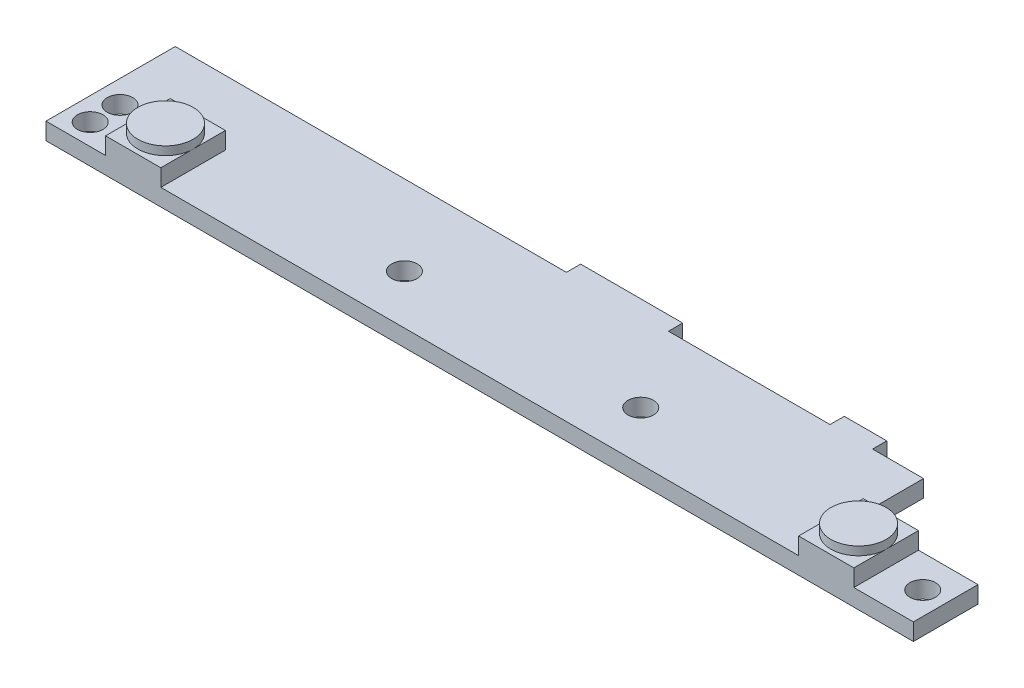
ISO-10303-21;
HEADER;
FILE_DESCRIPTION(('STEP AP214'),'2;1');
FILE_NAME('part.step','',(''),(''),'','','');
FILE_SCHEMA(('AUTOMOTIVE_DESIGN { 1 0 10303 214 1 1 1 1 }'));
ENDSEC;
DATA;
#1=APPLICATION_CONTEXT('core data for automotive mechanical design processes');
#2=APPLICATION_PROTOCOL_DEFINITION('international standard','automotive_design',2000,#1);
#3=PRODUCT_CONTEXT('',#1,'mechanical');
#4=PRODUCT('Part','Part','',(#3));
#5=PRODUCT_RELATED_PRODUCT_CATEGORY('part','',(#4));
#6=PRODUCT_DEFINITION_FORMATION('','',#4);
#7=PRODUCT_DEFINITION_CONTEXT('part definition',#1,'design');
#8=PRODUCT_DEFINITION('design','',#6,#7);
#9=PRODUCT_DEFINITION_SHAPE('','',#8);
#10=(LENGTH_UNIT() NAMED_UNIT(*) SI_UNIT(.MILLI.,.METRE.));
#11=(NAMED_UNIT(*) PLANE_ANGLE_UNIT() SI_UNIT($,.RADIAN.));
#12=(NAMED_UNIT(*) SI_UNIT($,.STERADIAN.) SOLID_ANGLE_UNIT());
#13=UNCERTAINTY_MEASURE_WITH_UNIT(LENGTH_MEASURE(1.E-05),#10,'distance_accuracy_value','');
#14=(GEOMETRIC_REPRESENTATION_CONTEXT(3) GLOBAL_UNCERTAINTY_ASSIGNED_CONTEXT((#13)) GLOBAL_UNIT_ASSIGNED_CONTEXT((#10,
#11,#12)) REPRESENTATION_CONTEXT('',''));
#15=CARTESIAN_POINT('',(0.,0.,0.));
#16=DIRECTION('',(0.,0.,1.));
#17=DIRECTION('',(1.,0.,0.));
#18=AXIS2_PLACEMENT_3D('',#15,#16,#17);
#19=CARTESIAN_POINT('',(0.,4.,0.));
#20=DIRECTION('',(0.,-1.,0.));
#21=DIRECTION('',(0.,0.,-1.));
#22=AXIS2_PLACEMENT_3D('',#19,#20,#21);
#23=PLANE('',#22);
#24=DIRECTION('',(0.,0.,-1.));
#25=VECTOR('',#24,1.);
#26=CARTESIAN_POINT('',(44.,4.,0.));
#27=LINE('',#26,#25);
#28=CARTESIAN_POINT('',(44.,4.,7.60000000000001));
#29=VERTEX_POINT('',#28);
#30=CARTESIAN_POINT('',(44.,4.,3.80000000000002));
#31=VERTEX_POINT('',#30);
#32=EDGE_CURVE('E207',#29,#31,#27,.T.);
#33=ORIENTED_EDGE('',*,*,#32,.T.);
#34=CARTESIAN_POINT('',(40.75,4.,3.80000000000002));
#35=DIRECTION('',(0.,1.,0.));
#36=DIRECTION('',(0.,0.,1.));
#37=AXIS2_PLACEMENT_3D('',#34,#35,#36);
#38=CIRCLE('',#37,3.25);
#39=CARTESIAN_POINT('',(37.5,4.,3.80000000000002));
#40=VERTEX_POINT('',#39);
#41=EDGE_CURVE('E51',#40,#31,#38,.T.);
#42=ORIENTED_EDGE('',*,*,#41,.F.);
#43=DIRECTION('',(0.,0.,1.));
#44=VECTOR('',#43,1.);
#45=CARTESIAN_POINT('',(37.5,4.,0.));
#46=LINE('',#45,#44);
#47=CARTESIAN_POINT('',(37.5,4.,7.6));
#48=VERTEX_POINT('',#47);
#49=EDGE_CURVE('E205',#40,#48,#46,.T.);
#50=ORIENTED_EDGE('',*,*,#49,.T.);
#51=DIRECTION('',(-1.,0.,0.));
#52=VECTOR('',#51,1.);
#53=CARTESIAN_POINT('',(51.,4.,7.6));
#54=LINE('',#53,#52);
#55=EDGE_CURVE('E235',#29,#48,#54,.T.);
#56=ORIENTED_EDGE('',*,*,#55,.F.);
#57=EDGE_LOOP('',(#33,#42,#50,#56));
#58=FACE_BOUND('',#57,.T.);
#59=ADVANCED_FACE('F35',(#58),#23,.F.);
#60=CARTESIAN_POINT('',(0.,4.,0.));
#61=DIRECTION('',(0.,-1.,0.));
#62=DIRECTION('',(0.,0.,-1.));
#63=AXIS2_PLACEMENT_3D('',#60,#61,#62);
#64=PLANE('',#63);
#65=DIRECTION('',(0.,0.,-1.));
#66=VECTOR('',#65,1.);
#67=CARTESIAN_POINT('',(-37.5,4.,0.));
#68=LINE('',#67,#66);
#69=CARTESIAN_POINT('',(-37.5,4.,7.60000000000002));
#70=VERTEX_POINT('',#69);
#71=CARTESIAN_POINT('',(-37.5,4.,3.80000000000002));
#72=VERTEX_POINT('',#71);
#73=EDGE_CURVE('E465',#70,#72,#68,.T.);
#74=ORIENTED_EDGE('',*,*,#73,.T.);
#75=CARTESIAN_POINT('',(-40.75,4.,3.80000000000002));
#76=DIRECTION('',(0.,-1.,0.));
#77=DIRECTION('',(0.,0.,-1.));
#78=AXIS2_PLACEMENT_3D('',#75,#76,#77);
#79=CIRCLE('',#78,3.25);
#80=CARTESIAN_POINT('',(-44.,4.00000000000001,3.80000000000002));
#81=VERTEX_POINT('',#80);
#82=EDGE_CURVE('E11',#72,#81,#79,.T.);
#83=ORIENTED_EDGE('',*,*,#82,.T.);
#84=DIRECTION('',(0.,0.,1.));
#85=VECTOR('',#84,1.);
#86=CARTESIAN_POINT('',(-44.,4.,7.60000000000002));
#87=LINE('',#86,#85);
#88=CARTESIAN_POINT('',(-44.,4.,7.60000000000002));
#89=VERTEX_POINT('',#88);
#90=EDGE_CURVE('E471',#81,#89,#87,.T.);
#91=ORIENTED_EDGE('',*,*,#90,.T.);
#92=DIRECTION('',(1.,0.,0.));
#93=VECTOR('',#92,1.);
#94=CARTESIAN_POINT('',(-37.5,4.,7.60000000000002));
#95=LINE('',#94,#93);
#96=EDGE_CURVE('E475',#89,#70,#95,.T.);
#97=ORIENTED_EDGE('',*,*,#96,.T.);
#98=EDGE_LOOP('',(#74,#83,#91,#97));
#99=FACE_BOUND('',#98,.T.);
#100=ADVANCED_FACE('F509',(#99),#64,.F.);
#101=CARTESIAN_POINT('',(-51.,2.,0.));
#102=DIRECTION('',(0.,-1.,0.));
#103=DIRECTION('',(0.,0.,-1.));
#104=AXIS2_PLACEMENT_3D('',#101,#102,#103);
#105=PLANE('',#104);
#106=CARTESIAN_POINT('',(-48.3,2.,5.10000000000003));
#107=DIRECTION('',(0.,-1.,0.));
#108=DIRECTION('',(0.,0.,-1.));
#109=AXIS2_PLACEMENT_3D('',#106,#107,#108);
#110=CIRCLE('',#109,1.49999999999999);
#111=CARTESIAN_POINT('',(-48.3,2.,3.60000000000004));
#112=VERTEX_POINT('',#111);
#113=EDGE_CURVE('E39',#112,#112,#110,.T.);
#114=ORIENTED_EDGE('',*,*,#113,.T.);
#115=EDGE_LOOP('',(#114));
#116=FACE_BOUND('',#115,.T.);
#117=CARTESIAN_POINT('',(13.1494661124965,2.,1.81030675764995));
#118=DIRECTION('',(0.,-1.,0.));
#119=DIRECTION('',(0.,0.,-1.));
#120=AXIS2_PLACEMENT_3D('',#117,#118,#119);
#121=CIRCLE('',#120,1.49999999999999);
#122=CARTESIAN_POINT('',(13.1494661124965,2.,0.310306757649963));
#123=VERTEX_POINT('',#122);
#124=EDGE_CURVE('E431',#123,#123,#121,.T.);
#125=ORIENTED_EDGE('',*,*,#124,.T.);
#126=EDGE_LOOP('',(#125));
#127=FACE_BOUND('',#126,.T.);
#128=CARTESIAN_POINT('',(-48.3,2.,1.60000000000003));
#129=DIRECTION('',(0.,-1.,0.));
#130=DIRECTION('',(0.,0.,-1.));
#131=AXIS2_PLACEMENT_3D('',#128,#129,#130);
#132=CIRCLE('',#131,1.49999999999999);
#133=CARTESIAN_POINT('',(-48.3,2.,0.100000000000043));
#134=VERTEX_POINT('',#133);
#135=EDGE_CURVE('E453',#134,#134,#132,.T.);
#136=ORIENTED_EDGE('',*,*,#135,.T.);
#137=EDGE_LOOP('',(#136));
#138=FACE_BOUND('',#137,.T.);
#139=CARTESIAN_POINT('',(-14.6390767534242,2.,1.81030675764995));
#140=DIRECTION('',(0.,-1.,0.));
#141=DIRECTION('',(0.,0.,-1.));
#142=AXIS2_PLACEMENT_3D('',#139,#140,#141);
#143=CIRCLE('',#142,1.49999999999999);
#144=CARTESIAN_POINT('',(-14.6390767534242,2.,0.310306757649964));
#145=VERTEX_POINT('',#144);
#146=EDGE_CURVE('E428',#145,#145,#143,.T.);
#147=ORIENTED_EDGE('',*,*,#146,.T.);
#148=EDGE_LOOP('',(#147));
#149=FACE_BOUND('',#148,.T.);
#150=DIRECTION('',(0.,0.,-1.));
#151=VECTOR('',#150,1.);
#152=CARTESIAN_POINT('',(-37.5,2.,0.));
#153=LINE('',#152,#151);
#154=CARTESIAN_POINT('',(-37.5,2.,7.60000000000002));
#155=VERTEX_POINT('',#154);
#156=CARTESIAN_POINT('',(-37.5,2.,0.));
#157=VERTEX_POINT('',#156);
#158=EDGE_CURVE('E464',#155,#157,#153,.T.);
#159=ORIENTED_EDGE('',*,*,#158,.F.);
#160=DIRECTION('',(1.,0.,0.));
#161=VECTOR('',#160,1.);
#162=CARTESIAN_POINT('',(-51.,2.,7.60000000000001));
#163=LINE('',#162,#161);
#164=CARTESIAN_POINT('',(37.5,2.,7.60000000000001));
#165=VERTEX_POINT('',#164);
#166=EDGE_CURVE('E262',#155,#165,#163,.T.);
#167=ORIENTED_EDGE('',*,*,#166,.T.);
#168=DIRECTION('',(0.,0.,1.));
#169=VECTOR('',#168,1.);
#170=CARTESIAN_POINT('',(37.5,2.,0.));
#171=LINE('',#170,#169);
#172=CARTESIAN_POINT('',(37.5,2.,0.));
#173=VERTEX_POINT('',#172);
#174=EDGE_CURVE('E218',#173,#165,#171,.T.);
#175=ORIENTED_EDGE('',*,*,#174,.F.);
#176=DIRECTION('',(1.,0.,0.));
#177=VECTOR('',#176,1.);
#178=CARTESIAN_POINT('',(-51.,2.,0.));
#179=LINE('',#178,#177);
#180=CARTESIAN_POINT('',(37.,2.,0.));
#181=VERTEX_POINT('',#180);
#182=EDGE_CURVE('E251',#181,#173,#179,.T.);
#183=ORIENTED_EDGE('',*,*,#182,.F.);
#184=DIRECTION('',(0.,0.,1.));
#185=VECTOR('',#184,1.);
#186=CARTESIAN_POINT('',(37.,2.,-9.27313022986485));
#187=LINE('',#186,#185);
#188=CARTESIAN_POINT('',(37.,2.,-7.60000000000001));
#189=VERTEX_POINT('',#188);
#190=EDGE_CURVE('E269',#189,#181,#187,.T.);
#191=ORIENTED_EDGE('',*,*,#190,.F.);
#192=DIRECTION('',(1.,0.,0.));
#193=VECTOR('',#192,1.);
#194=CARTESIAN_POINT('',(31.,2.,-7.60000000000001));
#195=LINE('',#194,#193);
#196=CARTESIAN_POINT('',(31.,2.,-7.60000000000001));
#197=VERTEX_POINT('',#196);
#198=EDGE_CURVE('E348',#197,#189,#195,.T.);
#199=ORIENTED_EDGE('',*,*,#198,.F.);
#200=DIRECTION('',(0.,0.,1.));
#201=VECTOR('',#200,1.);
#202=CARTESIAN_POINT('',(31.,2.,-9.27313022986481));
#203=LINE('',#202,#201);
#204=CARTESIAN_POINT('',(31.,2.,-9.27313022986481));
#205=VERTEX_POINT('',#204);
#206=EDGE_CURVE('E345',#205,#197,#203,.T.);
#207=ORIENTED_EDGE('',*,*,#206,.F.);
#208=DIRECTION('',(1.,0.,0.));
#209=VECTOR('',#208,1.);
#210=CARTESIAN_POINT('',(37.,2.,-9.27313022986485));
#211=LINE('',#210,#209);
#212=CARTESIAN_POINT('',(26.,2.,-9.2731302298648));
#213=VERTEX_POINT('',#212);
#214=EDGE_CURVE('E377',#213,#205,#211,.T.);
#215=ORIENTED_EDGE('',*,*,#214,.F.);
#216=DIRECTION('',(0.,0.,-1.));
#217=VECTOR('',#216,1.);
#218=CARTESIAN_POINT('',(26.,2.,-7.60000000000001));
#219=LINE('',#218,#217);
#220=CARTESIAN_POINT('',(26.,2.,-7.60000000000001));
#221=VERTEX_POINT('',#220);
#222=EDGE_CURVE('E358',#221,#213,#219,.T.);
#223=ORIENTED_EDGE('',*,*,#222,.F.);
#224=DIRECTION('',(1.,0.,0.));
#225=VECTOR('',#224,1.);
#226=CARTESIAN_POINT('',(7.,2.,-7.6));
#227=LINE('',#226,#225);
#228=CARTESIAN_POINT('',(7.,2.,-7.6));
#229=VERTEX_POINT('',#228);
#230=EDGE_CURVE('E363',#229,#221,#227,.T.);
#231=ORIENTED_EDGE('',*,*,#230,.F.);
#232=DIRECTION('',(0.,0.,1.));
#233=VECTOR('',#232,1.);
#234=CARTESIAN_POINT('',(7.,2.,-9.2731302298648));
#235=LINE('',#234,#233);
#236=CARTESIAN_POINT('',(7.,2.,-9.2731302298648));
#237=VERTEX_POINT('',#236);
#238=EDGE_CURVE('E360',#237,#229,#235,.T.);
#239=ORIENTED_EDGE('',*,*,#238,.F.);
#240=CARTESIAN_POINT('',(-5.,2.,-9.27313022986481));
#241=VERTEX_POINT('',#240);
#242=EDGE_CURVE('E275',#241,#237,#211,.T.);
#243=ORIENTED_EDGE('',*,*,#242,.F.);
#244=DIRECTION('',(0.,0.,1.));
#245=VECTOR('',#244,1.);
#246=CARTESIAN_POINT('',(-4.99999999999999,2.,0.));
#247=LINE('',#246,#245);
#248=CARTESIAN_POINT('',(-5.,2.,-7.6));
#249=VERTEX_POINT('',#248);
#250=EDGE_CURVE('E341',#241,#249,#247,.T.);
#251=ORIENTED_EDGE('',*,*,#250,.T.);
#252=DIRECTION('',(-1.,0.,0.));
#253=VECTOR('',#252,1.);
#254=CARTESIAN_POINT('',(-51.,2.,-7.59999999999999));
#255=LINE('',#254,#253);
#256=CARTESIAN_POINT('',(-51.,2.,-7.59999999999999));
#257=VERTEX_POINT('',#256);
#258=EDGE_CURVE('E827',#249,#257,#255,.T.);
#259=ORIENTED_EDGE('',*,*,#258,.T.);
#260=DIRECTION('',(0.,0.,1.));
#261=VECTOR('',#260,1.);
#262=CARTESIAN_POINT('',(-51.,2.,0.));
#263=LINE('',#262,#261);
#264=CARTESIAN_POINT('',(-51.,2.,7.60000000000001));
#265=VERTEX_POINT('',#264);
#266=EDGE_CURVE('E232',#257,#265,#263,.T.);
#267=ORIENTED_EDGE('',*,*,#266,.T.);
#268=CARTESIAN_POINT('',(-44.,2.,7.60000000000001));
#269=VERTEX_POINT('',#268);
#270=EDGE_CURVE('E261',#265,#269,#163,.T.);
#271=ORIENTED_EDGE('',*,*,#270,.T.);
#272=DIRECTION('',(0.,0.,1.));
#273=VECTOR('',#272,1.);
#274=CARTESIAN_POINT('',(-44.,2.,7.60000000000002));
#275=LINE('',#274,#273);
#276=CARTESIAN_POINT('',(-44.,2.,0.));
#277=VERTEX_POINT('',#276);
#278=EDGE_CURVE('E483',#277,#269,#275,.T.);
#279=ORIENTED_EDGE('',*,*,#278,.F.);
#280=DIRECTION('',(-1.,0.,0.));
#281=VECTOR('',#280,1.);
#282=CARTESIAN_POINT('',(-44.,2.,0.));
#283=LINE('',#282,#281);
#284=EDGE_CURVE('E480',#157,#277,#283,.T.);
#285=ORIENTED_EDGE('',*,*,#284,.F.);
#286=EDGE_LOOP('',(#159,#167,#175,#183,#191,#199,#207,#215,#223,#231,#239,#243,#251,#259,#267,
#271,#279,#285));
#287=FACE_BOUND('',#286,.T.);
#288=ADVANCED_FACE('F390',(#116,#127,#138,#149,#287),#105,.F.);
#289=CARTESIAN_POINT('',(0.,0.,-9.27313022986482));
#290=DIRECTION('',(0.,0.,1.));
#291=DIRECTION('',(1.,0.,0.));
#292=AXIS2_PLACEMENT_3D('',#289,#290,#291);
#293=PLANE('',#292);
#294=ORIENTED_EDGE('',*,*,#214,.T.);
#295=DIRECTION('',(0.,1.,0.));
#296=VECTOR('',#295,1.);
#297=CARTESIAN_POINT('',(31.,-5.00000000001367E-05,-9.27313022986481));
#298=LINE('',#297,#296);
#299=CARTESIAN_POINT('',(31.,0.,-9.27313022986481));
#300=VERTEX_POINT('',#299);
#301=EDGE_CURVE('E350',#300,#205,#298,.T.);
#302=ORIENTED_EDGE('',*,*,#301,.F.);
#303=DIRECTION('',(-1.,0.,0.));
#304=VECTOR('',#303,1.);
#305=CARTESIAN_POINT('',(-51.,0.,-9.27313022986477));
#306=LINE('',#305,#304);
#307=CARTESIAN_POINT('',(26.,0.,-9.2731302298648));
#308=VERTEX_POINT('',#307);
#309=EDGE_CURVE('E376',#300,#308,#306,.T.);
#310=ORIENTED_EDGE('',*,*,#309,.T.);
#311=DIRECTION('',(0.,1.,0.));
#312=VECTOR('',#311,1.);
#313=CARTESIAN_POINT('',(26.,0.,-9.27313022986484));
#314=LINE('',#313,#312);
#315=EDGE_CURVE('E278',#308,#213,#314,.T.);
#316=ORIENTED_EDGE('',*,*,#315,.T.);
#317=EDGE_LOOP('',(#294,#302,#310,#316));
#318=FACE_BOUND('',#317,.T.);
#319=ADVANCED_FACE('F385',(#318),#293,.F.);
#320=CARTESIAN_POINT('',(51.,4.,7.6));
#321=DIRECTION('',(0.,0.,1.));
#322=DIRECTION('',(1.,0.,0.));
#323=AXIS2_PLACEMENT_3D('',#320,#321,#322);
#324=PLANE('',#323);
#325=DIRECTION('',(1.,0.,0.));
#326=VECTOR('',#325,1.);
#327=CARTESIAN_POINT('',(44.,2.,7.60000000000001));
#328=LINE('',#327,#326);
#329=CARTESIAN_POINT('',(44.,2.,7.60000000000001));
#330=VERTEX_POINT('',#329);
#331=CARTESIAN_POINT('',(51.,2.,7.60000000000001));
#332=VERTEX_POINT('',#331);
#333=EDGE_CURVE('E323',#330,#332,#328,.T.);
#334=ORIENTED_EDGE('',*,*,#333,.F.);
#335=DIRECTION('',(0.,-1.,0.));
#336=VECTOR('',#335,1.);
#337=CARTESIAN_POINT('',(44.,4.,7.60000000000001));
#338=LINE('',#337,#336);
#339=EDGE_CURVE('E325',#29,#330,#338,.T.);
#340=ORIENTED_EDGE('',*,*,#339,.F.);
#341=ORIENTED_EDGE('',*,*,#55,.T.);
#342=DIRECTION('',(0.,1.,0.));
#343=VECTOR('',#342,1.);
#344=CARTESIAN_POINT('',(37.5,2.,7.60000000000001));
#345=LINE('',#344,#343);
#346=EDGE_CURVE('E217',#165,#48,#345,.T.);
#347=ORIENTED_EDGE('',*,*,#346,.F.);
#348=ORIENTED_EDGE('',*,*,#166,.F.);
#349=DIRECTION('',(0.,-1.,0.));
#350=VECTOR('',#349,1.);
#351=CARTESIAN_POINT('',(-37.5,4.,7.60000000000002));
#352=LINE('',#351,#350);
#353=EDGE_CURVE('E477',#70,#155,#352,.T.);
#354=ORIENTED_EDGE('',*,*,#353,.F.);
#355=ORIENTED_EDGE('',*,*,#96,.F.);
#356=DIRECTION('',(0.,-1.,0.));
#357=VECTOR('',#356,1.);
#358=CARTESIAN_POINT('',(-44.,4.,7.60000000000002));
#359=LINE('',#358,#357);
#360=EDGE_CURVE('E487',#89,#269,#359,.T.);
#361=ORIENTED_EDGE('',*,*,#360,.T.);
#362=ORIENTED_EDGE('',*,*,#270,.F.);
#363=DIRECTION('',(0.,-1.,0.));
#364=VECTOR('',#363,1.);
#365=CARTESIAN_POINT('',(-51.,4.,7.60000000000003));
#366=LINE('',#365,#364);
#367=CARTESIAN_POINT('',(-51.,0.,7.60000000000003));
#368=VERTEX_POINT('',#367);
#369=EDGE_CURVE('E238',#265,#368,#366,.T.);
#370=ORIENTED_EDGE('',*,*,#369,.T.);
#371=DIRECTION('',(-1.,0.,0.));
#372=VECTOR('',#371,1.);
#373=CARTESIAN_POINT('',(51.,0.,7.6));
#374=LINE('',#373,#372);
#375=CARTESIAN_POINT('',(51.,0.,7.6));
#376=VERTEX_POINT('',#375);
#377=EDGE_CURVE('E224',#376,#368,#374,.T.);
#378=ORIENTED_EDGE('',*,*,#377,.F.);
#379=DIRECTION('',(0.,-1.,0.));
#380=VECTOR('',#379,1.);
#381=CARTESIAN_POINT('',(51.,4.,7.6));
#382=LINE('',#381,#380);
#383=EDGE_CURVE('E288',#332,#376,#382,.T.);
#384=ORIENTED_EDGE('',*,*,#383,.F.);
#385=EDGE_LOOP('',(#334,#340,#341,#347,#348,#354,#355,#361,#362,#370,#378,#384));
#386=FACE_BOUND('',#385,.T.);
#387=ADVANCED_FACE('F37',(#386),#324,.T.);
#388=CARTESIAN_POINT('',(51.,4.,0.));
#389=DIRECTION('',(1.,0.,0.));
#390=DIRECTION('',(0.,0.,-1.));
#391=AXIS2_PLACEMENT_3D('',#388,#389,#390);
#392=PLANE('',#391);
#393=DIRECTION('',(0.,0.,1.));
#394=VECTOR('',#393,1.);
#395=CARTESIAN_POINT('',(51.,2.,-9.27313022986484));
#396=LINE('',#395,#394);
#397=CARTESIAN_POINT('',(51.,2.,0.));
#398=VERTEX_POINT('',#397);
#399=EDGE_CURVE('E317',#398,#332,#396,.T.);
#400=ORIENTED_EDGE('',*,*,#399,.T.);
#401=ORIENTED_EDGE('',*,*,#383,.T.);
#402=DIRECTION('',(0.,0.,1.));
#403=VECTOR('',#402,1.);
#404=CARTESIAN_POINT('',(51.,0.,0.));
#405=LINE('',#404,#403);
#406=CARTESIAN_POINT('',(51.,0.,0.));
#407=VERTEX_POINT('',#406);
#408=EDGE_CURVE('E237',#407,#376,#405,.T.);
#409=ORIENTED_EDGE('',*,*,#408,.F.);
#410=DIRECTION('',(0.,-1.,0.));
#411=VECTOR('',#410,1.);
#412=CARTESIAN_POINT('',(51.,4.,0.));
#413=LINE('',#412,#411);
#414=EDGE_CURVE('E294',#398,#407,#413,.T.);
#415=ORIENTED_EDGE('',*,*,#414,.F.);
#416=EDGE_LOOP('',(#400,#401,#409,#415));
#417=FACE_BOUND('',#416,.T.);
#418=ADVANCED_FACE('F316',(#417),#392,.T.);
#419=CARTESIAN_POINT('',(-51.,4.,0.));
#420=DIRECTION('',(0.,0.,-1.));
#421=DIRECTION('',(-1.,0.,0.));
#422=AXIS2_PLACEMENT_3D('',#419,#420,#421);
#423=PLANE('',#422);
#424=DIRECTION('',(-1.,0.,0.));
#425=VECTOR('',#424,1.);
#426=CARTESIAN_POINT('',(-51.,2.,0.));
#427=LINE('',#426,#425);
#428=CARTESIAN_POINT('',(44.,2.,0.));
#429=VERTEX_POINT('',#428);
#430=EDGE_CURVE('E44',#398,#429,#427,.T.);
#431=ORIENTED_EDGE('',*,*,#430,.F.);
#432=ORIENTED_EDGE('',*,*,#414,.T.);
#433=DIRECTION('',(1.,0.,0.));
#434=VECTOR('',#433,1.);
#435=CARTESIAN_POINT('',(-51.,0.,0.));
#436=LINE('',#435,#434);
#437=CARTESIAN_POINT('',(37.,0.,0.));
#438=VERTEX_POINT('',#437);
#439=EDGE_CURVE('E242',#438,#407,#436,.T.);
#440=ORIENTED_EDGE('',*,*,#439,.F.);
#441=DIRECTION('',(0.,-1.,0.));
#442=VECTOR('',#441,1.);
#443=CARTESIAN_POINT('',(37.,0.,0.));
#444=LINE('',#443,#442);
#445=EDGE_CURVE('E285',#181,#438,#444,.T.);
#446=ORIENTED_EDGE('',*,*,#445,.F.);
#447=ORIENTED_EDGE('',*,*,#182,.T.);
#448=DIRECTION('',(0.,1.,0.));
#449=VECTOR('',#448,1.);
#450=CARTESIAN_POINT('',(37.5,2.,0.));
#451=LINE('',#450,#449);
#452=CARTESIAN_POINT('',(37.5,4.,0.));
#453=VERTEX_POINT('',#452);
#454=EDGE_CURVE('E234',#173,#453,#451,.T.);
#455=ORIENTED_EDGE('',*,*,#454,.T.);
#456=DIRECTION('',(1.,0.,0.));
#457=VECTOR('',#456,1.);
#458=CARTESIAN_POINT('',(-51.,4.,0.));
#459=LINE('',#458,#457);
#460=CARTESIAN_POINT('',(44.,4.,0.));
#461=VERTEX_POINT('',#460);
#462=EDGE_CURVE('E223',#453,#461,#459,.T.);
#463=ORIENTED_EDGE('',*,*,#462,.T.);
#464=DIRECTION('',(0.,1.,0.));
#465=VECTOR('',#464,1.);
#466=CARTESIAN_POINT('',(44.,4.,0.));
#467=LINE('',#466,#465);
#468=EDGE_CURVE('E319',#429,#461,#467,.T.);
#469=ORIENTED_EDGE('',*,*,#468,.F.);
#470=EDGE_LOOP('',(#431,#432,#440,#446,#447,#455,#463,#469));
#471=FACE_BOUND('',#470,.T.);
#472=ADVANCED_FACE('F417',(#471),#423,.T.);
#473=CARTESIAN_POINT('',(-51.,4.,7.60000000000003));
#474=DIRECTION('',(-1.,0.,0.));
#475=DIRECTION('',(0.,0.,1.));
#476=AXIS2_PLACEMENT_3D('',#473,#474,#475);
#477=PLANE('',#476);
#478=DIRECTION('',(0.,-1.,0.));
#479=VECTOR('',#478,1.);
#480=CARTESIAN_POINT('',(-51.,4.,-7.59999999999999));
#481=LINE('',#480,#479);
#482=CARTESIAN_POINT('',(-51.,0.,-7.59999999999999));
#483=VERTEX_POINT('',#482);
#484=EDGE_CURVE('E313',#257,#483,#481,.T.);
#485=ORIENTED_EDGE('',*,*,#484,.T.);
#486=DIRECTION('',(0.,0.,-1.));
#487=VECTOR('',#486,1.);
#488=CARTESIAN_POINT('',(-51.,0.,7.60000000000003));
#489=LINE('',#488,#487);
#490=EDGE_CURVE('E226',#368,#483,#489,.T.);
#491=ORIENTED_EDGE('',*,*,#490,.F.);
#492=ORIENTED_EDGE('',*,*,#369,.F.);
#493=ORIENTED_EDGE('',*,*,#266,.F.);
#494=EDGE_LOOP('',(#485,#491,#492,#493));
#495=FACE_BOUND('',#494,.T.);
#496=ADVANCED_FACE('F312',(#495),#477,.T.);
#497=EDGE_CURVE('E213',#453,#40,#46,.T.);
#498=ORIENTED_EDGE('',*,*,#497,.T.);
#499=EDGE_CURVE('E193',#31,#40,#38,.T.);
#500=ORIENTED_EDGE('',*,*,#499,.F.);
#501=EDGE_CURVE('E422',#31,#461,#27,.T.);
#502=ORIENTED_EDGE('',*,*,#501,.T.);
#503=ORIENTED_EDGE('',*,*,#462,.F.);
#504=EDGE_LOOP('',(#498,#500,#502,#503));
#505=FACE_BOUND('',#504,.T.);
#506=ADVANCED_FACE('F221',(#505),#23,.F.);
#507=CARTESIAN_POINT('',(0.,0.,0.));
#508=DIRECTION('',(0.,-1.,0.));
#509=DIRECTION('',(0.,0.,-1.));
#510=AXIS2_PLACEMENT_3D('',#507,#508,#509);
#511=PLANE('',#510);
#512=CARTESIAN_POINT('',(-48.3,0.,5.10000000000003));
#513=DIRECTION('',(0.,-1.,0.));
#514=DIRECTION('',(0.,0.,-1.));
#515=AXIS2_PLACEMENT_3D('',#512,#513,#514);
#516=CIRCLE('',#515,1.49999999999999);
#517=CARTESIAN_POINT('',(-48.3,0.,3.60000000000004));
#518=VERTEX_POINT('',#517);
#519=EDGE_CURVE('E445',#518,#518,#516,.T.);
#520=ORIENTED_EDGE('',*,*,#519,.F.);
#521=EDGE_LOOP('',(#520));
#522=FACE_BOUND('',#521,.T.);
#523=CARTESIAN_POINT('',(13.1494661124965,0.,1.81030675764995));
#524=DIRECTION('',(0.,-1.,0.));
#525=DIRECTION('',(0.,0.,-1.));
#526=AXIS2_PLACEMENT_3D('',#523,#524,#525);
#527=CIRCLE('',#526,1.49999999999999);
#528=CARTESIAN_POINT('',(13.1494661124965,0.,0.310306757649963));
#529=VERTEX_POINT('',#528);
#530=EDGE_CURVE('E434',#529,#529,#527,.T.);
#531=ORIENTED_EDGE('',*,*,#530,.F.);
#532=EDGE_LOOP('',(#531));
#533=FACE_BOUND('',#532,.T.);
#534=CARTESIAN_POINT('',(48.3,0.,3.79999999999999));
#535=DIRECTION('',(0.,-1.,0.));
#536=DIRECTION('',(0.,0.,-1.));
#537=AXIS2_PLACEMENT_3D('',#534,#535,#536);
#538=CIRCLE('',#537,1.49999999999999);
#539=CARTESIAN_POINT('',(48.3,0.,2.3));
#540=VERTEX_POINT('',#539);
#541=EDGE_CURVE('E433',#540,#540,#538,.T.);
#542=ORIENTED_EDGE('',*,*,#541,.F.);
#543=EDGE_LOOP('',(#542));
#544=FACE_BOUND('',#543,.T.);
#545=CARTESIAN_POINT('',(-48.3,0.,1.60000000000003));
#546=DIRECTION('',(0.,-1.,0.));
#547=DIRECTION('',(0.,0.,-1.));
#548=AXIS2_PLACEMENT_3D('',#545,#546,#547);
#549=CIRCLE('',#548,1.49999999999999);
#550=CARTESIAN_POINT('',(-48.3,0.,0.100000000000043));
#551=VERTEX_POINT('',#550);
#552=EDGE_CURVE('E450',#551,#551,#549,.T.);
#553=ORIENTED_EDGE('',*,*,#552,.F.);
#554=EDGE_LOOP('',(#553));
#555=FACE_BOUND('',#554,.T.);
#556=CARTESIAN_POINT('',(-14.6390767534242,0.,1.81030675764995));
#557=DIRECTION('',(0.,-1.,0.));
#558=DIRECTION('',(0.,0.,-1.));
#559=AXIS2_PLACEMENT_3D('',#556,#557,#558);
#560=CIRCLE('',#559,1.49999999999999);
#561=CARTESIAN_POINT('',(-14.6390767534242,0.,0.310306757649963));
#562=VERTEX_POINT('',#561);
#563=EDGE_CURVE('E430',#562,#562,#560,.T.);
#564=ORIENTED_EDGE('',*,*,#563,.F.);
#565=EDGE_LOOP('',(#564));
#566=FACE_BOUND('',#565,.T.);
#567=DIRECTION('',(-1.,0.,0.));
#568=VECTOR('',#567,1.);
#569=CARTESIAN_POINT('',(-5.,0.,-7.6));
#570=LINE('',#569,#568);
#571=CARTESIAN_POINT('',(-5.,0.,-7.6));
#572=VERTEX_POINT('',#571);
#573=EDGE_CURVE('E337',#572,#483,#570,.T.);
#574=ORIENTED_EDGE('',*,*,#573,.F.);
#575=DIRECTION('',(0.,0.,1.));
#576=VECTOR('',#575,1.);
#577=CARTESIAN_POINT('',(-5.,0.,-9.27313022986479));
#578=LINE('',#577,#576);
#579=CARTESIAN_POINT('',(-5.,0.,-9.27313022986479));
#580=VERTEX_POINT('',#579);
#581=EDGE_CURVE('E334',#580,#572,#578,.T.);
#582=ORIENTED_EDGE('',*,*,#581,.F.);
#583=CARTESIAN_POINT('',(7.,0.,-9.27313022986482));
#584=VERTEX_POINT('',#583);
#585=EDGE_CURVE('E378',#584,#580,#306,.T.);
#586=ORIENTED_EDGE('',*,*,#585,.F.);
#587=DIRECTION('',(0.,0.,-1.));
#588=VECTOR('',#587,1.);
#589=CARTESIAN_POINT('',(6.99999999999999,0.,0.));
#590=LINE('',#589,#588);
#591=CARTESIAN_POINT('',(7.,0.,-7.6));
#592=VERTEX_POINT('',#591);
#593=EDGE_CURVE('E369',#592,#584,#590,.T.);
#594=ORIENTED_EDGE('',*,*,#593,.F.);
#595=DIRECTION('',(-1.,0.,0.));
#596=VECTOR('',#595,1.);
#597=CARTESIAN_POINT('',(0.,0.,-7.6));
#598=LINE('',#597,#596);
#599=CARTESIAN_POINT('',(26.,0.,-7.60000000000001));
#600=VERTEX_POINT('',#599);
#601=EDGE_CURVE('E374',#600,#592,#598,.T.);
#602=ORIENTED_EDGE('',*,*,#601,.F.);
#603=DIRECTION('',(0.,0.,1.));
#604=VECTOR('',#603,1.);
#605=CARTESIAN_POINT('',(26.,0.,0.));
#606=LINE('',#605,#604);
#607=EDGE_CURVE('E372',#308,#600,#606,.T.);
#608=ORIENTED_EDGE('',*,*,#607,.F.);
#609=ORIENTED_EDGE('',*,*,#309,.F.);
#610=DIRECTION('',(0.,0.,-1.));
#611=VECTOR('',#610,1.);
#612=CARTESIAN_POINT('',(31.,0.,0.));
#613=LINE('',#612,#611);
#614=CARTESIAN_POINT('',(31.,0.,-7.60000000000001));
#615=VERTEX_POINT('',#614);
#616=EDGE_CURVE('E356',#615,#300,#613,.T.);
#617=ORIENTED_EDGE('',*,*,#616,.F.);
#618=DIRECTION('',(-1.,0.,0.));
#619=VECTOR('',#618,1.);
#620=CARTESIAN_POINT('',(0.,0.,-7.6));
#621=LINE('',#620,#619);
#622=CARTESIAN_POINT('',(37.,0.,-7.60000000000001));
#623=VERTEX_POINT('',#622);
#624=EDGE_CURVE('E353',#623,#615,#621,.T.);
#625=ORIENTED_EDGE('',*,*,#624,.F.);
#626=DIRECTION('',(0.,0.,1.));
#627=VECTOR('',#626,1.);
#628=CARTESIAN_POINT('',(37.,0.,-9.27313022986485));
#629=LINE('',#628,#627);
#630=EDGE_CURVE('E266',#623,#438,#629,.T.);
#631=ORIENTED_EDGE('',*,*,#630,.T.);
#632=ORIENTED_EDGE('',*,*,#439,.T.);
#633=ORIENTED_EDGE('',*,*,#408,.T.);
#634=ORIENTED_EDGE('',*,*,#377,.T.);
#635=ORIENTED_EDGE('',*,*,#490,.T.);
#636=EDGE_LOOP('',(#574,#582,#586,#594,#602,#608,#609,#617,#625,#631,#632,#633,#634,#635));
#637=FACE_BOUND('',#636,.T.);
#638=ADVANCED_FACE('F315',(#522,#533,#544,#555,#566,#637),#511,.T.);
#639=CARTESIAN_POINT('',(37.5,2.,0.));
#640=DIRECTION('',(1.,0.,0.));
#641=DIRECTION('',(0.,1.,0.));
#642=AXIS2_PLACEMENT_3D('',#639,#640,#641);
#643=PLANE('',#642);
#644=ORIENTED_EDGE('',*,*,#346,.T.);
#645=ORIENTED_EDGE('',*,*,#49,.F.);
#646=ORIENTED_EDGE('',*,*,#497,.F.);
#647=ORIENTED_EDGE('',*,*,#454,.F.);
#648=ORIENTED_EDGE('',*,*,#174,.T.);
#649=EDGE_LOOP('',(#644,#645,#646,#647,#648));
#650=FACE_BOUND('',#649,.T.);
#651=ADVANCED_FACE('F211',(#650),#643,.F.);
#652=CARTESIAN_POINT('',(37.,0.,-9.27313022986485));
#653=DIRECTION('',(-1.,0.,0.));
#654=DIRECTION('',(0.,0.,1.));
#655=AXIS2_PLACEMENT_3D('',#652,#653,#654);
#656=PLANE('',#655);
#657=ORIENTED_EDGE('',*,*,#630,.F.);
#658=DIRECTION('',(0.,1.,0.));
#659=VECTOR('',#658,1.);
#660=CARTESIAN_POINT('',(37.,0.,-7.60000000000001));
#661=LINE('',#660,#659);
#662=EDGE_CURVE('E282',#623,#189,#661,.T.);
#663=ORIENTED_EDGE('',*,*,#662,.T.);
#664=ORIENTED_EDGE('',*,*,#190,.T.);
#665=ORIENTED_EDGE('',*,*,#445,.T.);
#666=EDGE_LOOP('',(#657,#663,#664,#665));
#667=FACE_BOUND('',#666,.T.);
#668=ADVANCED_FACE('F414',(#667),#656,.F.);
#669=ORIENTED_EDGE('',*,*,#585,.T.);
#670=DIRECTION('',(0.,1.,0.));
#671=VECTOR('',#670,1.);
#672=CARTESIAN_POINT('',(-5.,0.,-9.27313022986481));
#673=LINE('',#672,#671);
#674=EDGE_CURVE('E826',#580,#241,#673,.T.);
#675=ORIENTED_EDGE('',*,*,#674,.T.);
#676=ORIENTED_EDGE('',*,*,#242,.T.);
#677=DIRECTION('',(0.,-1.,0.));
#678=VECTOR('',#677,1.);
#679=CARTESIAN_POINT('',(7.,0.,-9.27313022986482));
#680=LINE('',#679,#678);
#681=EDGE_CURVE('E286',#237,#584,#680,.T.);
#682=ORIENTED_EDGE('',*,*,#681,.T.);
#683=EDGE_LOOP('',(#669,#675,#676,#682));
#684=FACE_BOUND('',#683,.T.);
#685=ADVANCED_FACE('F553',(#684),#293,.F.);
#686=CARTESIAN_POINT('',(26.,-5.00000000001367E-05,-7.60000000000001));
#687=DIRECTION('',(1.,0.,0.));
#688=DIRECTION('',(0.,0.,-1.));
#689=AXIS2_PLACEMENT_3D('',#686,#687,#688);
#690=PLANE('',#689);
#691=ORIENTED_EDGE('',*,*,#607,.T.);
#692=DIRECTION('',(0.,1.,0.));
#693=VECTOR('',#692,1.);
#694=CARTESIAN_POINT('',(26.,-5.00000000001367E-05,-7.60000000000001));
#695=LINE('',#694,#693);
#696=EDGE_CURVE('E367',#600,#221,#695,.T.);
#697=ORIENTED_EDGE('',*,*,#696,.T.);
#698=ORIENTED_EDGE('',*,*,#222,.T.);
#699=ORIENTED_EDGE('',*,*,#315,.F.);
#700=EDGE_LOOP('',(#691,#697,#698,#699));
#701=FACE_BOUND('',#700,.T.);
#702=ADVANCED_FACE('F401',(#701),#690,.F.);
#703=CARTESIAN_POINT('',(7.,-5.00000000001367E-05,-7.6));
#704=DIRECTION('',(0.,0.,1.));
#705=DIRECTION('',(1.,0.,0.));
#706=AXIS2_PLACEMENT_3D('',#703,#704,#705);
#707=PLANE('',#706);
#708=ORIENTED_EDGE('',*,*,#601,.T.);
#709=DIRECTION('',(0.,1.,0.));
#710=VECTOR('',#709,1.);
#711=CARTESIAN_POINT('',(7.,-5.00000000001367E-05,-7.6));
#712=LINE('',#711,#710);
#713=EDGE_CURVE('E366',#592,#229,#712,.T.);
#714=ORIENTED_EDGE('',*,*,#713,.T.);
#715=ORIENTED_EDGE('',*,*,#230,.T.);
#716=ORIENTED_EDGE('',*,*,#696,.F.);
#717=EDGE_LOOP('',(#708,#714,#715,#716));
#718=FACE_BOUND('',#717,.T.);
#719=ADVANCED_FACE('F404',(#718),#707,.F.);
#720=CARTESIAN_POINT('',(7.,-5.00000000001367E-05,-9.2731302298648));
#721=DIRECTION('',(-1.,0.,0.));
#722=DIRECTION('',(0.,0.,1.));
#723=AXIS2_PLACEMENT_3D('',#720,#721,#722);
#724=PLANE('',#723);
#725=ORIENTED_EDGE('',*,*,#593,.T.);
#726=ORIENTED_EDGE('',*,*,#681,.F.);
#727=ORIENTED_EDGE('',*,*,#238,.T.);
#728=ORIENTED_EDGE('',*,*,#713,.F.);
#729=EDGE_LOOP('',(#725,#726,#727,#728));
#730=FACE_BOUND('',#729,.T.);
#731=ADVANCED_FACE('F408',(#730),#724,.F.);
#732=CARTESIAN_POINT('',(31.,-5.00000000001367E-05,-7.60000000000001));
#733=DIRECTION('',(0.,0.,1.));
#734=DIRECTION('',(1.,0.,0.));
#735=AXIS2_PLACEMENT_3D('',#732,#733,#734);
#736=PLANE('',#735);
#737=ORIENTED_EDGE('',*,*,#624,.T.);
#738=DIRECTION('',(0.,1.,0.));
#739=VECTOR('',#738,1.);
#740=CARTESIAN_POINT('',(31.,-5.00000000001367E-05,-7.60000000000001));
#741=LINE('',#740,#739);
#742=EDGE_CURVE('E351',#615,#197,#741,.T.);
#743=ORIENTED_EDGE('',*,*,#742,.T.);
#744=ORIENTED_EDGE('',*,*,#198,.T.);
#745=ORIENTED_EDGE('',*,*,#662,.F.);
#746=EDGE_LOOP('',(#737,#743,#744,#745));
#747=FACE_BOUND('',#746,.T.);
#748=ADVANCED_FACE('F786',(#747),#736,.F.);
#749=CARTESIAN_POINT('',(31.,-5.00000000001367E-05,-9.27313022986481));
#750=DIRECTION('',(-1.,0.,0.));
#751=DIRECTION('',(0.,0.,1.));
#752=AXIS2_PLACEMENT_3D('',#749,#750,#751);
#753=PLANE('',#752);
#754=ORIENTED_EDGE('',*,*,#616,.T.);
#755=ORIENTED_EDGE('',*,*,#301,.T.);
#756=ORIENTED_EDGE('',*,*,#206,.T.);
#757=ORIENTED_EDGE('',*,*,#742,.F.);
#758=EDGE_LOOP('',(#754,#755,#756,#757));
#759=FACE_BOUND('',#758,.T.);
#760=ADVANCED_FACE('F396',(#759),#753,.F.);
#761=CARTESIAN_POINT('',(-5.,4.,-7.6));
#762=DIRECTION('',(0.,0.,1.));
#763=DIRECTION('',(1.,0.,0.));
#764=AXIS2_PLACEMENT_3D('',#761,#762,#763);
#765=PLANE('',#764);
#766=DIRECTION('',(0.,-1.,0.));
#767=VECTOR('',#766,1.);
#768=CARTESIAN_POINT('',(-5.,4.,-7.6));
#769=LINE('',#768,#767);
#770=EDGE_CURVE('E339',#249,#572,#769,.T.);
#771=ORIENTED_EDGE('',*,*,#770,.T.);
#772=ORIENTED_EDGE('',*,*,#573,.T.);
#773=ORIENTED_EDGE('',*,*,#484,.F.);
#774=ORIENTED_EDGE('',*,*,#258,.F.);
#775=EDGE_LOOP('',(#771,#772,#773,#774));
#776=FACE_BOUND('',#775,.T.);
#777=ADVANCED_FACE('F736',(#776),#765,.F.);
#778=CARTESIAN_POINT('',(-5.,4.,-9.27313022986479));
#779=DIRECTION('',(1.,0.,0.));
#780=DIRECTION('',(0.,0.,-1.));
#781=AXIS2_PLACEMENT_3D('',#778,#779,#780);
#782=PLANE('',#781);
#783=ORIENTED_EDGE('',*,*,#674,.F.);
#784=ORIENTED_EDGE('',*,*,#581,.T.);
#785=ORIENTED_EDGE('',*,*,#770,.F.);
#786=ORIENTED_EDGE('',*,*,#250,.F.);
#787=EDGE_LOOP('',(#783,#784,#785,#786));
#788=FACE_BOUND('',#787,.T.);
#789=ADVANCED_FACE('F592',(#788),#782,.F.);
#790=CARTESIAN_POINT('',(44.,2.,-9.27313022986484));
#791=DIRECTION('',(0.,-1.,0.));
#792=DIRECTION('',(0.,0.,-1.));
#793=AXIS2_PLACEMENT_3D('',#790,#791,#792);
#794=PLANE('',#793);
#795=CARTESIAN_POINT('',(48.3,2.,3.79999999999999));
#796=DIRECTION('',(0.,-1.,0.));
#797=DIRECTION('',(0.,0.,-1.));
#798=AXIS2_PLACEMENT_3D('',#795,#796,#797);
#799=CIRCLE('',#798,1.49999999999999);
#800=CARTESIAN_POINT('',(48.3,2.,2.3));
#801=VERTEX_POINT('',#800);
#802=EDGE_CURVE('E438',#801,#801,#799,.T.);
#803=ORIENTED_EDGE('',*,*,#802,.T.);
#804=EDGE_LOOP('',(#803));
#805=FACE_BOUND('',#804,.T.);
#806=ORIENTED_EDGE('',*,*,#430,.T.);
#807=DIRECTION('',(0.,0.,1.));
#808=VECTOR('',#807,1.);
#809=CARTESIAN_POINT('',(44.,2.,-9.27313022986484));
#810=LINE('',#809,#808);
#811=EDGE_CURVE('E320',#429,#330,#810,.T.);
#812=ORIENTED_EDGE('',*,*,#811,.T.);
#813=ORIENTED_EDGE('',*,*,#333,.T.);
#814=ORIENTED_EDGE('',*,*,#399,.F.);
#815=EDGE_LOOP('',(#806,#812,#813,#814));
#816=FACE_BOUND('',#815,.T.);
#817=ADVANCED_FACE('F423',(#805,#816),#794,.F.);
#818=CARTESIAN_POINT('',(44.,4.,-9.27313022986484));
#819=DIRECTION('',(-1.,0.,0.));
#820=DIRECTION('',(0.,0.,1.));
#821=AXIS2_PLACEMENT_3D('',#818,#819,#820);
#822=PLANE('',#821);
#823=ORIENTED_EDGE('',*,*,#468,.T.);
#824=ORIENTED_EDGE('',*,*,#501,.F.);
#825=ORIENTED_EDGE('',*,*,#32,.F.);
#826=ORIENTED_EDGE('',*,*,#339,.T.);
#827=ORIENTED_EDGE('',*,*,#811,.F.);
#828=EDGE_LOOP('',(#823,#824,#825,#826,#827));
#829=FACE_BOUND('',#828,.T.);
#830=ADVANCED_FACE('F421',(#829),#822,.F.);
#831=CARTESIAN_POINT('',(-37.5,4.,0.));
#832=DIRECTION('',(-1.,0.,0.));
#833=DIRECTION('',(0.,0.,1.));
#834=AXIS2_PLACEMENT_3D('',#831,#832,#833);
#835=PLANE('',#834);
#836=ORIENTED_EDGE('',*,*,#158,.T.);
#837=DIRECTION('',(0.,-1.,0.));
#838=VECTOR('',#837,1.);
#839=CARTESIAN_POINT('',(-37.5,4.,0.));
#840=LINE('',#839,#838);
#841=CARTESIAN_POINT('',(-37.5,4.,0.));
#842=VERTEX_POINT('',#841);
#843=EDGE_CURVE('E328',#842,#157,#840,.T.);
#844=ORIENTED_EDGE('',*,*,#843,.F.);
#845=EDGE_CURVE('E469',#72,#842,#68,.T.);
#846=ORIENTED_EDGE('',*,*,#845,.F.);
#847=ORIENTED_EDGE('',*,*,#73,.F.);
#848=ORIENTED_EDGE('',*,*,#353,.T.);
#849=EDGE_LOOP('',(#836,#844,#846,#847,#848));
#850=FACE_BOUND('',#849,.T.);
#851=ADVANCED_FACE('F499',(#850),#835,.F.);
#852=CARTESIAN_POINT('',(-44.,4.,0.));
#853=DIRECTION('',(0.,0.,1.));
#854=DIRECTION('',(1.,0.,0.));
#855=AXIS2_PLACEMENT_3D('',#852,#853,#854);
#856=PLANE('',#855);
#857=ORIENTED_EDGE('',*,*,#284,.T.);
#858=DIRECTION('',(0.,-1.,0.));
#859=VECTOR('',#858,1.);
#860=CARTESIAN_POINT('',(-44.,4.,0.));
#861=LINE('',#860,#859);
#862=CARTESIAN_POINT('',(-44.,4.,0.));
#863=VERTEX_POINT('',#862);
#864=EDGE_CURVE('E489',#863,#277,#861,.T.);
#865=ORIENTED_EDGE('',*,*,#864,.F.);
#866=DIRECTION('',(-1.,0.,0.));
#867=VECTOR('',#866,1.);
#868=CARTESIAN_POINT('',(-44.,4.,0.));
#869=LINE('',#868,#867);
#870=EDGE_CURVE('E468',#842,#863,#869,.T.);
#871=ORIENTED_EDGE('',*,*,#870,.F.);
#872=ORIENTED_EDGE('',*,*,#843,.T.);
#873=EDGE_LOOP('',(#857,#865,#871,#872));
#874=FACE_BOUND('',#873,.T.);
#875=ADVANCED_FACE('F495',(#874),#856,.F.);
#876=CARTESIAN_POINT('',(-44.,4.,7.60000000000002));
#877=DIRECTION('',(1.,0.,0.));
#878=DIRECTION('',(0.,0.,-1.));
#879=AXIS2_PLACEMENT_3D('',#876,#877,#878);
#880=PLANE('',#879);
#881=ORIENTED_EDGE('',*,*,#278,.T.);
#882=ORIENTED_EDGE('',*,*,#360,.F.);
#883=ORIENTED_EDGE('',*,*,#90,.F.);
#884=EDGE_CURVE('E472',#863,#81,#87,.T.);
#885=ORIENTED_EDGE('',*,*,#884,.F.);
#886=ORIENTED_EDGE('',*,*,#864,.T.);
#887=EDGE_LOOP('',(#881,#882,#883,#885,#886));
#888=FACE_BOUND('',#887,.T.);
#889=ADVANCED_FACE('F504',(#888),#880,.F.);
#890=ORIENTED_EDGE('',*,*,#884,.T.);
#891=CARTESIAN_POINT('',(-40.75,4.00000000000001,3.80000000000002));
#892=DIRECTION('',(0.,1.,0.));
#893=DIRECTION('',(0.,0.,1.));
#894=AXIS2_PLACEMENT_3D('',#891,#892,#893);
#895=CIRCLE('',#894,3.25);
#896=EDGE_CURVE('E462',#72,#81,#895,.T.);
#897=ORIENTED_EDGE('',*,*,#896,.F.);
#898=ORIENTED_EDGE('',*,*,#845,.T.);
#899=ORIENTED_EDGE('',*,*,#870,.T.);
#900=EDGE_LOOP('',(#890,#897,#898,#899));
#901=FACE_BOUND('',#900,.T.);
#902=ADVANCED_FACE('F511',(#901),#64,.F.);
#903=CARTESIAN_POINT('',(-40.75,4.,3.80000000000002));
#904=DIRECTION('',(0.,1.,0.));
#905=DIRECTION('',(0.,0.,1.));
#906=AXIS2_PLACEMENT_3D('',#903,#904,#905);
#907=CYLINDRICAL_SURFACE('',#906,3.25);
#908=ORIENTED_EDGE('',*,*,#896,.T.);
#909=ORIENTED_EDGE('',*,*,#82,.F.);
#910=EDGE_LOOP('',(#908,#909));
#911=FACE_BOUND('',#910,.T.);
#912=CARTESIAN_POINT('',(-40.75,5.,3.80000000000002));
#913=DIRECTION('',(0.,1.,0.));
#914=DIRECTION('',(0.,0.,1.));
#915=AXIS2_PLACEMENT_3D('',#912,#913,#914);
#916=CIRCLE('',#915,3.25);
#917=CARTESIAN_POINT('',(-40.75,5.,7.05000000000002));
#918=VERTEX_POINT('',#917);
#919=EDGE_CURVE('E199',#918,#918,#916,.T.);
#920=ORIENTED_EDGE('',*,*,#919,.F.);
#921=EDGE_LOOP('',(#920));
#922=FACE_BOUND('',#921,.T.);
#923=ADVANCED_FACE('F512',(#911,#922),#907,.T.);
#924=CARTESIAN_POINT('',(-40.75,5.,3.80000000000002));
#925=DIRECTION('',(0.,1.,0.));
#926=DIRECTION('',(0.,0.,1.));
#927=AXIS2_PLACEMENT_3D('',#924,#925,#926);
#928=PLANE('',#927);
#929=ORIENTED_EDGE('',*,*,#919,.T.);
#930=EDGE_LOOP('',(#929));
#931=FACE_BOUND('',#930,.T.);
#932=ADVANCED_FACE('F515',(#931),#928,.T.);
#933=CARTESIAN_POINT('',(40.75,4.,3.80000000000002));
#934=DIRECTION('',(0.,1.,0.));
#935=DIRECTION('',(0.,0.,1.));
#936=AXIS2_PLACEMENT_3D('',#933,#934,#935);
#937=CYLINDRICAL_SURFACE('',#936,3.25);
#938=ORIENTED_EDGE('',*,*,#499,.T.);
#939=ORIENTED_EDGE('',*,*,#41,.T.);
#940=EDGE_LOOP('',(#938,#939));
#941=FACE_BOUND('',#940,.T.);
#942=CARTESIAN_POINT('',(40.75,5.,3.80000000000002));
#943=DIRECTION('',(0.,1.,0.));
#944=DIRECTION('',(0.,0.,1.));
#945=AXIS2_PLACEMENT_3D('',#942,#943,#944);
#946=CIRCLE('',#945,3.25);
#947=CARTESIAN_POINT('',(40.75,5.,7.05000000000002));
#948=VERTEX_POINT('',#947);
#949=EDGE_CURVE('E208',#948,#948,#946,.T.);
#950=ORIENTED_EDGE('',*,*,#949,.F.);
#951=EDGE_LOOP('',(#950));
#952=FACE_BOUND('',#951,.T.);
#953=ADVANCED_FACE('F194',(#941,#952),#937,.T.);
#954=CARTESIAN_POINT('',(40.75,5.,3.80000000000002));
#955=DIRECTION('',(0.,1.,0.));
#956=DIRECTION('',(0.,0.,1.));
#957=AXIS2_PLACEMENT_3D('',#954,#955,#956);
#958=PLANE('',#957);
#959=ORIENTED_EDGE('',*,*,#949,.T.);
#960=EDGE_LOOP('',(#959));
#961=FACE_BOUND('',#960,.T.);
#962=ADVANCED_FACE('F524',(#961),#958,.T.);
#963=CARTESIAN_POINT('',(-14.6390767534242,0.,1.81030675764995));
#964=DIRECTION('',(0.,-1.,0.));
#965=DIRECTION('',(0.,0.,-1.));
#966=AXIS2_PLACEMENT_3D('',#963,#964,#965);
#967=CYLINDRICAL_SURFACE('',#966,1.49999999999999);
#968=ORIENTED_EDGE('',*,*,#563,.T.);
#969=EDGE_LOOP('',(#968));
#970=FACE_BOUND('',#969,.T.);
#971=ORIENTED_EDGE('',*,*,#146,.F.);
#972=EDGE_LOOP('',(#971));
#973=FACE_BOUND('',#972,.T.);
#974=ADVANCED_FACE('F602',(#970,#973),#967,.F.);
#975=CARTESIAN_POINT('',(-48.3,0.,1.60000000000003));
#976=DIRECTION('',(0.,-1.,0.));
#977=DIRECTION('',(0.,0.,-1.));
#978=AXIS2_PLACEMENT_3D('',#975,#976,#977);
#979=CYLINDRICAL_SURFACE('',#978,1.49999999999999);
#980=ORIENTED_EDGE('',*,*,#552,.T.);
#981=EDGE_LOOP('',(#980));
#982=FACE_BOUND('',#981,.T.);
#983=ORIENTED_EDGE('',*,*,#135,.F.);
#984=EDGE_LOOP('',(#983));
#985=FACE_BOUND('',#984,.T.);
#986=ADVANCED_FACE('F607',(#982,#985),#979,.F.);
#987=CARTESIAN_POINT('',(48.3,0.,3.79999999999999));
#988=DIRECTION('',(0.,-1.,0.));
#989=DIRECTION('',(0.,0.,-1.));
#990=AXIS2_PLACEMENT_3D('',#987,#988,#989);
#991=CYLINDRICAL_SURFACE('',#990,1.49999999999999);
#992=ORIENTED_EDGE('',*,*,#541,.T.);
#993=EDGE_LOOP('',(#992));
#994=FACE_BOUND('',#993,.T.);
#995=ORIENTED_EDGE('',*,*,#802,.F.);
#996=EDGE_LOOP('',(#995));
#997=FACE_BOUND('',#996,.T.);
#998=ADVANCED_FACE('F619',(#994,#997),#991,.F.);
#999=CARTESIAN_POINT('',(13.1494661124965,0.,1.81030675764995));
#1000=DIRECTION('',(0.,-1.,0.));
#1001=DIRECTION('',(0.,0.,-1.));
#1002=AXIS2_PLACEMENT_3D('',#999,#1000,#1001);
#1003=CYLINDRICAL_SURFACE('',#1002,1.49999999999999);
#1004=ORIENTED_EDGE('',*,*,#530,.T.);
#1005=EDGE_LOOP('',(#1004));
#1006=FACE_BOUND('',#1005,.T.);
#1007=ORIENTED_EDGE('',*,*,#124,.F.);
#1008=EDGE_LOOP('',(#1007));
#1009=FACE_BOUND('',#1008,.T.);
#1010=ADVANCED_FACE('F629',(#1006,#1009),#1003,.F.);
#1011=CARTESIAN_POINT('',(-48.3,0.,5.10000000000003));
#1012=DIRECTION('',(0.,-1.,0.));
#1013=DIRECTION('',(0.,0.,-1.));
#1014=AXIS2_PLACEMENT_3D('',#1011,#1012,#1013);
#1015=CYLINDRICAL_SURFACE('',#1014,1.49999999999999);
#1016=ORIENTED_EDGE('',*,*,#519,.T.);
#1017=EDGE_LOOP('',(#1016));
#1018=FACE_BOUND('',#1017,.T.);
#1019=ORIENTED_EDGE('',*,*,#113,.F.);
#1020=EDGE_LOOP('',(#1019));
#1021=FACE_BOUND('',#1020,.T.);
#1022=ADVANCED_FACE('F639',(#1018,#1021),#1015,.F.);
#1023=CLOSED_SHELL('',(#59,#100,#288,#319,#387,#418,#472,#496,#506,#638,#651,#668,#685,#702,
#719,#731,#748,#760,#777,#789,#817,#830,#851,#875,#889,#902,#923,#932,#953,#962,#974,#986,#998,
#1010,#1022));
#1024=MANIFOLD_SOLID_BREP('B2',#1023);
#1025=ADVANCED_BREP_SHAPE_REPRESENTATION('',(#18,#1024),#14);
#1026=SHAPE_DEFINITION_REPRESENTATION(#9,#1025);
ENDSEC;
END-ISO-10303-21;
